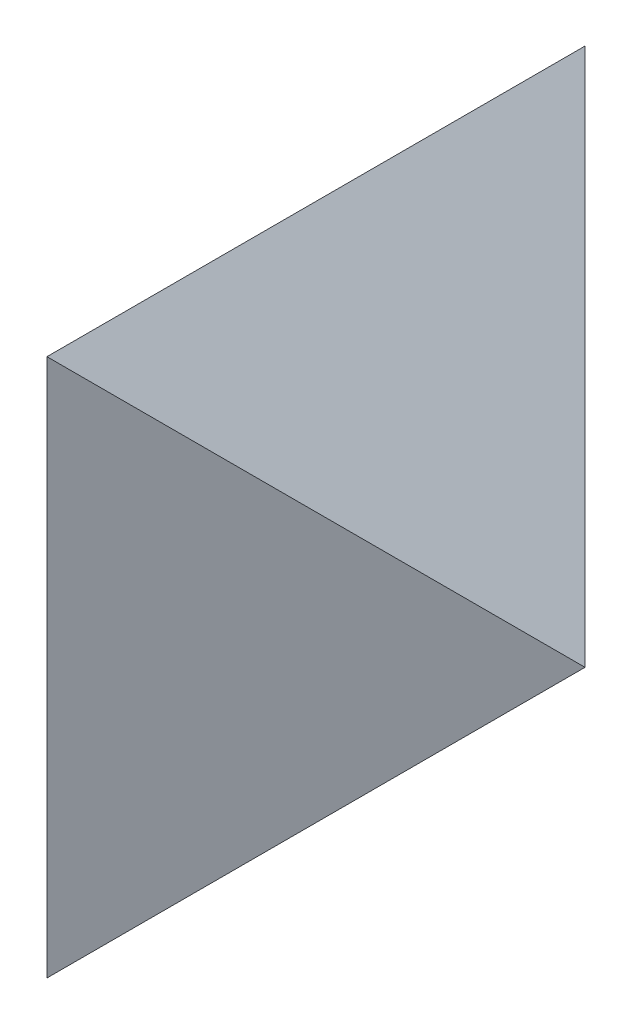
ISO-10303-21;
HEADER;
FILE_DESCRIPTION(('STEP AP214'),'2;1');
FILE_NAME('part.step','',(''),(''),'','','');
FILE_SCHEMA(('AUTOMOTIVE_DESIGN { 1 0 10303 214 1 1 1 1 }'));
ENDSEC;
DATA;
#1=APPLICATION_CONTEXT('core data for automotive mechanical design processes');
#2=APPLICATION_PROTOCOL_DEFINITION('international standard','automotive_design',2000,#1);
#3=PRODUCT_CONTEXT('',#1,'mechanical');
#4=PRODUCT('Part','Part','',(#3));
#5=PRODUCT_RELATED_PRODUCT_CATEGORY('part','',(#4));
#6=PRODUCT_DEFINITION_FORMATION('','',#4);
#7=PRODUCT_DEFINITION_CONTEXT('part definition',#1,'design');
#8=PRODUCT_DEFINITION('design','',#6,#7);
#9=PRODUCT_DEFINITION_SHAPE('','',#8);
#10=(LENGTH_UNIT() NAMED_UNIT(*) SI_UNIT(.MILLI.,.METRE.));
#11=(NAMED_UNIT(*) PLANE_ANGLE_UNIT() SI_UNIT($,.RADIAN.));
#12=(NAMED_UNIT(*) SI_UNIT($,.STERADIAN.) SOLID_ANGLE_UNIT());
#13=UNCERTAINTY_MEASURE_WITH_UNIT(LENGTH_MEASURE(1.E-05),#10,'distance_accuracy_value','');
#14=(GEOMETRIC_REPRESENTATION_CONTEXT(3) GLOBAL_UNCERTAINTY_ASSIGNED_CONTEXT((#13)) GLOBAL_UNIT_ASSIGNED_CONTEXT((#10,
#11,#12)) REPRESENTATION_CONTEXT('',''));
#15=CARTESIAN_POINT('',(0.,0.,0.));
#16=DIRECTION('',(0.,0.,1.));
#17=DIRECTION('',(1.,0.,0.));
#18=AXIS2_PLACEMENT_3D('',#15,#16,#17);
#19=CARTESIAN_POINT('',(162.5,7.85,-2.15));
#20=DIRECTION('',(-0.707106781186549,0.,0.707106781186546));
#21=DIRECTION('',(0.707106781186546,0.,0.707106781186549));
#22=AXIS2_PLACEMENT_3D('',#19,#20,#21);
#23=PLANE('',#22);
#24=DIRECTION('',(0.,-1.,0.));
#25=VECTOR('',#24,1.);
#26=CARTESIAN_POINT('',(162.5,7.85,-2.15));
#27=LINE('',#26,#25);
#28=CARTESIAN_POINT('',(162.5,7.85,-2.15));
#29=VERTEX_POINT('',#28);
#30=CARTESIAN_POINT('',(162.5,2.15,-2.15));
#31=VERTEX_POINT('',#30);
#32=EDGE_CURVE('E143',#29,#31,#27,.T.);
#33=ORIENTED_EDGE('',*,*,#32,.F.);
#34=DIRECTION('',(0.577350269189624,0.577350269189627,0.577350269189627));
#35=VECTOR('',#34,1.);
#36=CARTESIAN_POINT('',(162.5,7.85,-2.15));
#37=LINE('',#36,#35);
#38=CARTESIAN_POINT('',(159.65,5.,-5.));
#39=VERTEX_POINT('',#38);
#40=EDGE_CURVE('E12',#39,#29,#37,.T.);
#41=ORIENTED_EDGE('',*,*,#40,.F.);
#42=DIRECTION('',(0.577350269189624,-0.577350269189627,0.577350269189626));
#43=VECTOR('',#42,1.);
#44=CARTESIAN_POINT('',(160.6,4.05,-4.05000000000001));
#45=LINE('',#44,#43);
#46=EDGE_CURVE('E102',#39,#31,#45,.T.);
#47=ORIENTED_EDGE('',*,*,#46,.T.);
#48=EDGE_LOOP('',(#33,#41,#47));
#49=FACE_BOUND('',#48,.T.);
#50=ADVANCED_FACE('F77',(#49),#23,.T.);
#51=CARTESIAN_POINT('',(162.5,7.85,-2.15));
#52=DIRECTION('',(-0.707106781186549,0.707106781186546,0.));
#53=DIRECTION('',(-0.707106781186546,-0.707106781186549,0.));
#54=AXIS2_PLACEMENT_3D('',#51,#52,#53);
#55=PLANE('',#54);
#56=DIRECTION('',(0.,0.,1.));
#57=VECTOR('',#56,1.);
#58=CARTESIAN_POINT('',(162.5,7.85,-2.15));
#59=LINE('',#58,#57);
#60=CARTESIAN_POINT('',(162.5,7.85,-7.85));
#61=VERTEX_POINT('',#60);
#62=EDGE_CURVE('E116',#61,#29,#59,.T.);
#63=ORIENTED_EDGE('',*,*,#62,.F.);
#64=DIRECTION('',(0.577350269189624,0.577350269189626,-0.577350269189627));
#65=VECTOR('',#64,1.);
#66=CARTESIAN_POINT('',(162.5,7.85,-7.85));
#67=LINE('',#66,#65);
#68=EDGE_CURVE('E81',#39,#61,#67,.T.);
#69=ORIENTED_EDGE('',*,*,#68,.F.);
#70=ORIENTED_EDGE('',*,*,#40,.T.);
#71=EDGE_LOOP('',(#63,#69,#70));
#72=FACE_BOUND('',#71,.T.);
#73=ADVANCED_FACE('F79',(#72),#55,.T.);
#74=CARTESIAN_POINT('',(162.5,7.85,-7.85));
#75=DIRECTION('',(-0.707106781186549,0.,-0.707106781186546));
#76=DIRECTION('',(-0.707106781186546,0.,0.707106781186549));
#77=AXIS2_PLACEMENT_3D('',#74,#75,#76);
#78=PLANE('',#77);
#79=DIRECTION('',(0.,1.,0.));
#80=VECTOR('',#79,1.);
#81=CARTESIAN_POINT('',(162.5,7.85,-7.85));
#82=LINE('',#81,#80);
#83=CARTESIAN_POINT('',(162.5,2.15,-7.85));
#84=VERTEX_POINT('',#83);
#85=EDGE_CURVE('E94',#84,#61,#82,.T.);
#86=ORIENTED_EDGE('',*,*,#85,.F.);
#87=DIRECTION('',(0.577350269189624,-0.577350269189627,-0.577350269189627));
#88=VECTOR('',#87,1.);
#89=CARTESIAN_POINT('',(160.6,4.05000000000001,-5.95));
#90=LINE('',#89,#88);
#91=EDGE_CURVE('E124',#39,#84,#90,.T.);
#92=ORIENTED_EDGE('',*,*,#91,.F.);
#93=ORIENTED_EDGE('',*,*,#68,.T.);
#94=EDGE_LOOP('',(#86,#92,#93));
#95=FACE_BOUND('',#94,.T.);
#96=ADVANCED_FACE('F123',(#95),#78,.T.);
#97=CARTESIAN_POINT('',(162.5,2.15,-2.15));
#98=DIRECTION('',(-0.707106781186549,-0.707106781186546,0.));
#99=DIRECTION('',(0.707106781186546,-0.707106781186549,0.));
#100=AXIS2_PLACEMENT_3D('',#97,#98,#99);
#101=PLANE('',#100);
#102=DIRECTION('',(0.,0.,-1.));
#103=VECTOR('',#102,1.);
#104=CARTESIAN_POINT('',(162.5,2.15,-2.15));
#105=LINE('',#104,#103);
#106=EDGE_CURVE('E140',#31,#84,#105,.T.);
#107=ORIENTED_EDGE('',*,*,#106,.F.);
#108=ORIENTED_EDGE('',*,*,#46,.F.);
#109=ORIENTED_EDGE('',*,*,#91,.T.);
#110=EDGE_LOOP('',(#107,#108,#109));
#111=FACE_BOUND('',#110,.T.);
#112=ADVANCED_FACE('F157',(#111),#101,.T.);
#113=CARTESIAN_POINT('',(162.5,7.85,-2.15));
#114=DIRECTION('',(0.707106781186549,0.,0.707106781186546));
#115=DIRECTION('',(-0.707106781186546,0.,0.707106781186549));
#116=AXIS2_PLACEMENT_3D('',#113,#114,#115);
#117=PLANE('',#116);
#118=ORIENTED_EDGE('',*,*,#32,.T.);
#119=DIRECTION('',(-0.577350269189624,-0.577350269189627,0.577350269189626));
#120=VECTOR('',#119,1.);
#121=CARTESIAN_POINT('',(164.4,4.05,-4.05000000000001));
#122=LINE('',#121,#120);
#123=CARTESIAN_POINT('',(165.35,5.,-5.));
#124=VERTEX_POINT('',#123);
#125=EDGE_CURVE('E121',#124,#31,#122,.T.);
#126=ORIENTED_EDGE('',*,*,#125,.F.);
#127=DIRECTION('',(-0.577350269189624,0.577350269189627,0.577350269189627));
#128=VECTOR('',#127,1.);
#129=CARTESIAN_POINT('',(162.5,7.85,-2.15));
#130=LINE('',#129,#128);
#131=EDGE_CURVE('E130',#124,#29,#130,.T.);
#132=ORIENTED_EDGE('',*,*,#131,.T.);
#133=EDGE_LOOP('',(#118,#126,#132));
#134=FACE_BOUND('',#133,.T.);
#135=ADVANCED_FACE('F161',(#134),#117,.T.);
#136=CARTESIAN_POINT('',(162.5,7.85,-2.15));
#137=DIRECTION('',(0.707106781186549,0.707106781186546,0.));
#138=DIRECTION('',(0.707106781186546,-0.707106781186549,0.));
#139=AXIS2_PLACEMENT_3D('',#136,#137,#138);
#140=PLANE('',#139);
#141=ORIENTED_EDGE('',*,*,#62,.T.);
#142=ORIENTED_EDGE('',*,*,#131,.F.);
#143=DIRECTION('',(-0.577350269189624,0.577350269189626,-0.577350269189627));
#144=VECTOR('',#143,1.);
#145=CARTESIAN_POINT('',(162.5,7.85,-7.85));
#146=LINE('',#145,#144);
#147=EDGE_CURVE('E127',#124,#61,#146,.T.);
#148=ORIENTED_EDGE('',*,*,#147,.T.);
#149=EDGE_LOOP('',(#141,#142,#148));
#150=FACE_BOUND('',#149,.T.);
#151=ADVANCED_FACE('F128',(#150),#140,.T.);
#152=CARTESIAN_POINT('',(162.5,7.85,-7.85));
#153=DIRECTION('',(0.707106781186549,0.,-0.707106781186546));
#154=DIRECTION('',(0.707106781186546,0.,0.707106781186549));
#155=AXIS2_PLACEMENT_3D('',#152,#153,#154);
#156=PLANE('',#155);
#157=ORIENTED_EDGE('',*,*,#85,.T.);
#158=ORIENTED_EDGE('',*,*,#147,.F.);
#159=DIRECTION('',(-0.577350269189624,-0.577350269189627,-0.577350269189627));
#160=VECTOR('',#159,1.);
#161=CARTESIAN_POINT('',(164.4,4.05000000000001,-5.95));
#162=LINE('',#161,#160);
#163=EDGE_CURVE('E135',#124,#84,#162,.T.);
#164=ORIENTED_EDGE('',*,*,#163,.T.);
#165=EDGE_LOOP('',(#157,#158,#164));
#166=FACE_BOUND('',#165,.T.);
#167=ADVANCED_FACE('F137',(#166),#156,.T.);
#168=CARTESIAN_POINT('',(162.5,2.15,-2.15));
#169=DIRECTION('',(0.707106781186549,-0.707106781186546,0.));
#170=DIRECTION('',(-0.707106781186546,-0.707106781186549,0.));
#171=AXIS2_PLACEMENT_3D('',#168,#169,#170);
#172=PLANE('',#171);
#173=ORIENTED_EDGE('',*,*,#106,.T.);
#174=ORIENTED_EDGE('',*,*,#163,.F.);
#175=ORIENTED_EDGE('',*,*,#125,.T.);
#176=EDGE_LOOP('',(#173,#174,#175));
#177=FACE_BOUND('',#176,.T.);
#178=ADVANCED_FACE('F163',(#177),#172,.T.);
#179=CLOSED_SHELL('',(#50,#73,#96,#112,#135,#151,#167,#178));
#180=MANIFOLD_SOLID_BREP('B2',#179);
#181=ADVANCED_BREP_SHAPE_REPRESENTATION('',(#18,#180),#14);
#182=SHAPE_DEFINITION_REPRESENTATION(#9,#181);
ENDSEC;
END-ISO-10303-21;
